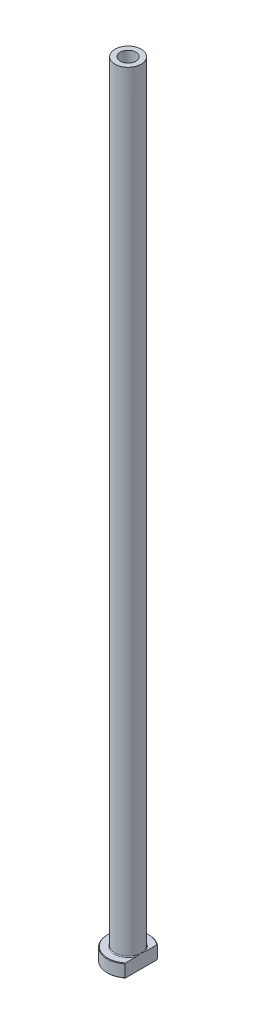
from build123d import *

# Parameters (mm, degrees)
FILLET1_R          = 0.3
CHAMFER1_SIZE      = 0.2
CUT_EXTRUDE1_DEPTH = 301.213257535
CHAMFER2_SIZE      = 0.5


with BuildPart() as part:
    # Sketch1 → Revolve1 (revolve)
    with BuildSketch(Plane.XY, mode=Mode.PRIVATE) as revolve1_sk:
        Polygon((-3, 300), (-5, 300), (-5, 5), (-8, 5), (-8, 0), (-3.25, 0), (-3.25, 243), (-3, 255), align=None)
    revolve(revolve1_sk.sketch.rotate(Axis((0, 92.187680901, 0), (0, -1, 0)), 270), axis=Axis((0, 92.187680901, 0), (0, -1, 0)))

    # Fillet1
    fillet1_edges = [part.edges().sort_by_distance(p)[0] for p in [
        (0, 5, -5),
    ]]
    fillet(fillet1_edges, radius=FILLET1_R)

    # Chamfer1
    chamfer1_edges = [part.edges().sort_by_distance(p)[0] for p in [
        (0, 0, -8),
        (0, 5, -8),
    ]]
    chamfer(chamfer1_edges, length=CHAMFER1_SIZE)

    # Sketch2 → Cut-Extrude1 (cut, through all)
    with BuildSketch(Plane.XZ):
        with BuildLine():
            Line((5, 6.244997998), (5, -6.244997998))
            ThreePointArc((5, -6.244997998), (8, 0), (5, 6.244997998))
        make_face()
    extrude(amount=-CUT_EXTRUDE1_DEPTH, mode=Mode.SUBTRACT)

    # Chamfer2
    chamfer2_edges = [part.edges().sort_by_distance(p)[0] for p in [
        (0, 0, -3.25),
    ]]
    chamfer(chamfer2_edges, length=CHAMFER2_SIZE)


solid = part.part
